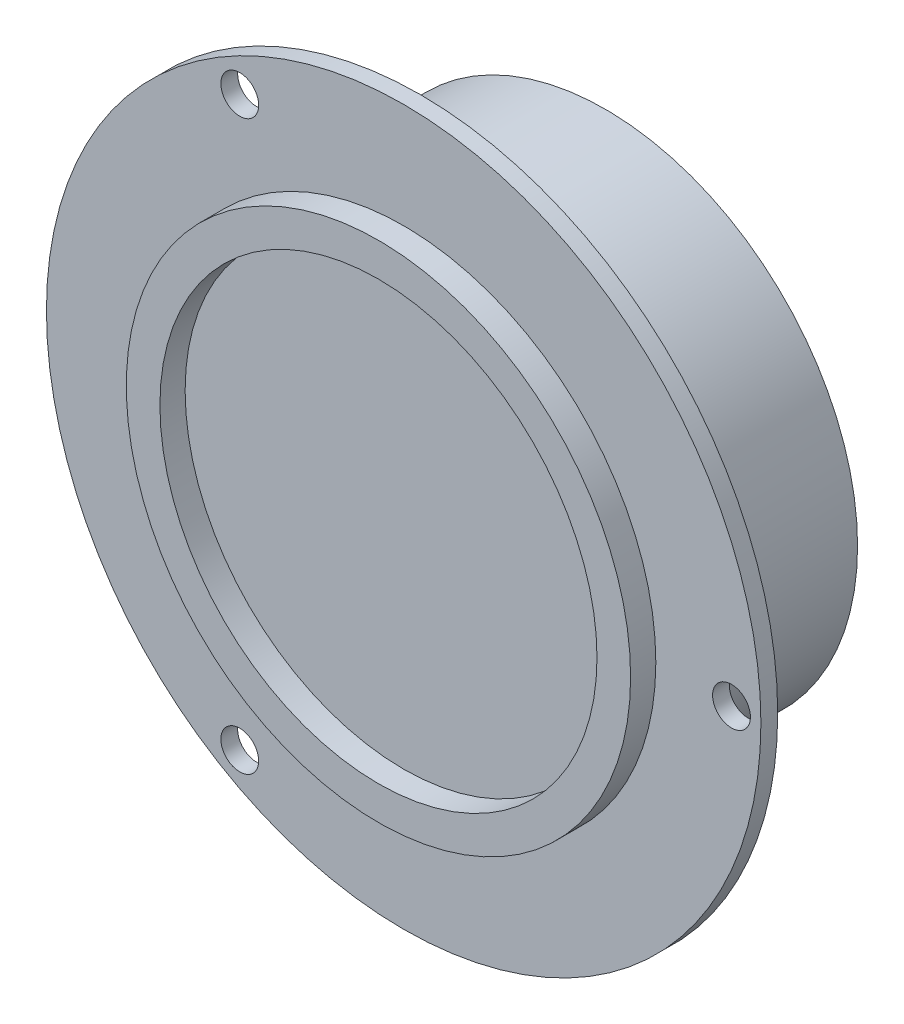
ISO-10303-21;
HEADER;
FILE_DESCRIPTION(('STEP AP214'),'2;1');
FILE_NAME('part.step','',(''),(''),'','','');
FILE_SCHEMA(('AUTOMOTIVE_DESIGN { 1 0 10303 214 1 1 1 1 }'));
ENDSEC;
DATA;
#1=APPLICATION_CONTEXT('core data for automotive mechanical design processes');
#2=APPLICATION_PROTOCOL_DEFINITION('international standard','automotive_design',2000,#1);
#3=PRODUCT_CONTEXT('',#1,'mechanical');
#4=PRODUCT('Part','Part','',(#3));
#5=PRODUCT_RELATED_PRODUCT_CATEGORY('part','',(#4));
#6=PRODUCT_DEFINITION_FORMATION('','',#4);
#7=PRODUCT_DEFINITION_CONTEXT('part definition',#1,'design');
#8=PRODUCT_DEFINITION('design','',#6,#7);
#9=PRODUCT_DEFINITION_SHAPE('','',#8);
#10=(LENGTH_UNIT() NAMED_UNIT(*) SI_UNIT(.MILLI.,.METRE.));
#11=(NAMED_UNIT(*) PLANE_ANGLE_UNIT() SI_UNIT($,.RADIAN.));
#12=(NAMED_UNIT(*) SI_UNIT($,.STERADIAN.) SOLID_ANGLE_UNIT());
#13=UNCERTAINTY_MEASURE_WITH_UNIT(LENGTH_MEASURE(1.E-05),#10,'distance_accuracy_value','');
#14=(GEOMETRIC_REPRESENTATION_CONTEXT(3) GLOBAL_UNCERTAINTY_ASSIGNED_CONTEXT((#13)) GLOBAL_UNIT_ASSIGNED_CONTEXT((#10,
#11,#12)) REPRESENTATION_CONTEXT('',''));
#15=CARTESIAN_POINT('',(0.,0.,0.));
#16=DIRECTION('',(0.,0.,1.));
#17=DIRECTION('',(1.,0.,0.));
#18=AXIS2_PLACEMENT_3D('',#15,#16,#17);
#19=CARTESIAN_POINT('',(0.,0.,0.));
#20=DIRECTION('',(0.,0.,1.));
#21=DIRECTION('',(1.,0.,0.));
#22=AXIS2_PLACEMENT_3D('',#19,#20,#21);
#23=PLANE('',#22);
#24=CARTESIAN_POINT('',(0.,0.,0.));
#25=DIRECTION('',(0.,0.,1.));
#26=DIRECTION('',(1.,0.,0.));
#27=AXIS2_PLACEMENT_3D('',#24,#25,#26);
#28=CIRCLE('',#27,30.);
#29=CARTESIAN_POINT('',(30.,0.,0.));
#30=VERTEX_POINT('',#29);
#31=EDGE_CURVE('E145',#30,#30,#28,.T.);
#32=ORIENTED_EDGE('',*,*,#31,.F.);
#33=EDGE_LOOP('',(#32));
#34=FACE_BOUND('',#33,.T.);
#35=DIRECTION('',(0.909272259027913,0.416201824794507,0.));
#36=VECTOR('',#35,1.);
#37=CARTESIAN_POINT('',(-5.64702244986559,4.01386814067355,0.));
#38=LINE('',#37,#36);
#39=CARTESIAN_POINT('',(-5.64702244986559,4.01386814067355,0.));
#40=VERTEX_POINT('',#39);
#41=CARTESIAN_POINT('',(0.652600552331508,6.89739896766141,0.));
#42=VERTEX_POINT('',#41);
#43=EDGE_CURVE('E108',#40,#42,#38,.T.);
#44=ORIENTED_EDGE('',*,*,#43,.F.);
#45=DIRECTION('',(0.0941947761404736,0.99555378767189,0.));
#46=VECTOR('',#45,1.);
#47=CARTESIAN_POINT('',(-6.2996230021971,-2.88353082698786,0.));
#48=LINE('',#47,#46);
#49=CARTESIAN_POINT('',(-6.2996230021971,-2.88353082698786,0.));
#50=VERTEX_POINT('',#49);
#51=EDGE_CURVE('E105',#50,#40,#48,.T.);
#52=ORIENTED_EDGE('',*,*,#51,.F.);
#53=DIRECTION('',(-0.815077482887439,0.579351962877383,0.));
#54=VECTOR('',#53,1.);
#55=CARTESIAN_POINT('',(-0.652600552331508,-6.89739896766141,0.));
#56=LINE('',#55,#54);
#57=CARTESIAN_POINT('',(-0.652600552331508,-6.89739896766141,0.));
#58=VERTEX_POINT('',#57);
#59=EDGE_CURVE('E163',#58,#50,#56,.T.);
#60=ORIENTED_EDGE('',*,*,#59,.F.);
#61=DIRECTION('',(-0.909272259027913,-0.416201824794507,0.));
#62=VECTOR('',#61,1.);
#63=CARTESIAN_POINT('',(5.64702244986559,-4.01386814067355,0.));
#64=LINE('',#63,#62);
#65=CARTESIAN_POINT('',(5.64702244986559,-4.01386814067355,0.));
#66=VERTEX_POINT('',#65);
#67=EDGE_CURVE('E180',#66,#58,#64,.T.);
#68=ORIENTED_EDGE('',*,*,#67,.F.);
#69=DIRECTION('',(-0.0941947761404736,-0.99555378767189,0.));
#70=VECTOR('',#69,1.);
#71=CARTESIAN_POINT('',(6.2996230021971,2.88353082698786,0.));
#72=LINE('',#71,#70);
#73=CARTESIAN_POINT('',(6.2996230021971,2.88353082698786,0.));
#74=VERTEX_POINT('',#73);
#75=EDGE_CURVE('E55',#74,#66,#72,.T.);
#76=ORIENTED_EDGE('',*,*,#75,.F.);
#77=DIRECTION('',(0.815077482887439,-0.579351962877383,0.));
#78=VECTOR('',#77,1.);
#79=CARTESIAN_POINT('',(0.652600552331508,6.89739896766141,0.));
#80=LINE('',#79,#78);
#81=EDGE_CURVE('E50',#42,#74,#80,.T.);
#82=ORIENTED_EDGE('',*,*,#81,.F.);
#83=EDGE_LOOP('',(#44,#52,#60,#68,#76,#82));
#84=FACE_BOUND('',#83,.T.);
#85=ADVANCED_FACE('F35',(#34,#84),#23,.F.);
#86=CARTESIAN_POINT('',(0.,0.,22.));
#87=DIRECTION('',(0.,0.,-1.));
#88=DIRECTION('',(-1.,0.,0.));
#89=AXIS2_PLACEMENT_3D('',#86,#87,#88);
#90=CYLINDRICAL_SURFACE('',#89,30.);
#91=CARTESIAN_POINT('',(0.,0.,22.));
#92=DIRECTION('',(0.,0.,1.));
#93=DIRECTION('',(1.,0.,0.));
#94=AXIS2_PLACEMENT_3D('',#91,#92,#93);
#95=CIRCLE('',#94,30.);
#96=CARTESIAN_POINT('',(30.,0.,22.));
#97=VERTEX_POINT('',#96);
#98=EDGE_CURVE('E43',#97,#97,#95,.T.);
#99=ORIENTED_EDGE('',*,*,#98,.F.);
#100=EDGE_LOOP('',(#99));
#101=FACE_BOUND('',#100,.T.);
#102=ORIENTED_EDGE('',*,*,#31,.T.);
#103=EDGE_LOOP('',(#102));
#104=FACE_BOUND('',#103,.T.);
#105=ADVANCED_FACE('F37',(#101,#104),#90,.T.);
#106=CARTESIAN_POINT('',(0.,0.,24.));
#107=DIRECTION('',(0.,0.,1.));
#108=DIRECTION('',(1.,0.,0.));
#109=AXIS2_PLACEMENT_3D('',#106,#107,#108);
#110=PLANE('',#109);
#111=CARTESIAN_POINT('',(0.,0.,24.));
#112=DIRECTION('',(0.,0.,1.));
#113=DIRECTION('',(1.,0.,0.));
#114=AXIS2_PLACEMENT_3D('',#111,#112,#113);
#115=CIRCLE('',#114,30.);
#116=CARTESIAN_POINT('',(30.,0.,24.));
#117=VERTEX_POINT('',#116);
#118=EDGE_CURVE('E112',#117,#117,#115,.T.);
#119=ORIENTED_EDGE('',*,*,#118,.F.);
#120=EDGE_LOOP('',(#119));
#121=FACE_BOUND('',#120,.T.);
#122=CARTESIAN_POINT('',(-19.5000000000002,-33.774990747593,24.));
#123=DIRECTION('',(0.,0.,1.));
#124=DIRECTION('',(1.,0.,0.));
#125=AXIS2_PLACEMENT_3D('',#122,#123,#124);
#126=CIRCLE('',#125,2.25);
#127=CARTESIAN_POINT('',(-17.2500000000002,-33.774990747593,24.));
#128=VERTEX_POINT('',#127);
#129=EDGE_CURVE('E130',#128,#128,#126,.T.);
#130=ORIENTED_EDGE('',*,*,#129,.F.);
#131=EDGE_LOOP('',(#130));
#132=FACE_BOUND('',#131,.T.);
#133=CARTESIAN_POINT('',(0.,0.,24.));
#134=DIRECTION('',(0.,0.,1.));
#135=DIRECTION('',(1.,0.,0.));
#136=AXIS2_PLACEMENT_3D('',#133,#134,#135);
#137=CIRCLE('',#136,42.5);
#138=CARTESIAN_POINT('',(42.5,0.,24.));
#139=VERTEX_POINT('',#138);
#140=EDGE_CURVE('E142',#139,#139,#137,.T.);
#141=ORIENTED_EDGE('',*,*,#140,.T.);
#142=EDGE_LOOP('',(#141));
#143=FACE_BOUND('',#142,.T.);
#144=CARTESIAN_POINT('',(39.,0.,24.));
#145=DIRECTION('',(0.,0.,1.));
#146=DIRECTION('',(1.,0.,0.));
#147=AXIS2_PLACEMENT_3D('',#144,#145,#146);
#148=CIRCLE('',#147,2.25);
#149=CARTESIAN_POINT('',(41.25,0.,24.));
#150=VERTEX_POINT('',#149);
#151=EDGE_CURVE('E136',#150,#150,#148,.T.);
#152=ORIENTED_EDGE('',*,*,#151,.F.);
#153=EDGE_LOOP('',(#152));
#154=FACE_BOUND('',#153,.T.);
#155=CARTESIAN_POINT('',(-19.4999999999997,33.7749907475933,24.));
#156=DIRECTION('',(0.,0.,1.));
#157=DIRECTION('',(1.,0.,0.));
#158=AXIS2_PLACEMENT_3D('',#155,#156,#157);
#159=CIRCLE('',#158,2.25000000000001);
#160=CARTESIAN_POINT('',(-17.2499999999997,33.7749907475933,24.));
#161=VERTEX_POINT('',#160);
#162=EDGE_CURVE('E124',#161,#161,#159,.T.);
#163=ORIENTED_EDGE('',*,*,#162,.F.);
#164=EDGE_LOOP('',(#163));
#165=FACE_BOUND('',#164,.T.);
#166=ADVANCED_FACE('F235',(#121,#132,#143,#154,#165),#110,.T.);
#167=CARTESIAN_POINT('',(0.,0.,22.));
#168=DIRECTION('',(0.,0.,1.));
#169=DIRECTION('',(1.,0.,0.));
#170=AXIS2_PLACEMENT_3D('',#167,#168,#169);
#171=PLANE('',#170);
#172=ORIENTED_EDGE('',*,*,#98,.T.);
#173=EDGE_LOOP('',(#172));
#174=FACE_BOUND('',#173,.T.);
#175=CARTESIAN_POINT('',(0.,0.,22.));
#176=DIRECTION('',(0.,0.,1.));
#177=DIRECTION('',(1.,0.,0.));
#178=AXIS2_PLACEMENT_3D('',#175,#176,#177);
#179=CIRCLE('',#178,42.5);
#180=CARTESIAN_POINT('',(42.5,0.,22.));
#181=VERTEX_POINT('',#180);
#182=EDGE_CURVE('E139',#181,#181,#179,.T.);
#183=ORIENTED_EDGE('',*,*,#182,.F.);
#184=EDGE_LOOP('',(#183));
#185=FACE_BOUND('',#184,.T.);
#186=CARTESIAN_POINT('',(39.,0.,22.));
#187=DIRECTION('',(0.,0.,1.));
#188=DIRECTION('',(1.,0.,0.));
#189=AXIS2_PLACEMENT_3D('',#186,#187,#188);
#190=CIRCLE('',#189,2.25);
#191=CARTESIAN_POINT('',(41.25,0.,22.));
#192=VERTEX_POINT('',#191);
#193=EDGE_CURVE('E133',#192,#192,#190,.T.);
#194=ORIENTED_EDGE('',*,*,#193,.T.);
#195=EDGE_LOOP('',(#194));
#196=FACE_BOUND('',#195,.T.);
#197=CARTESIAN_POINT('',(-19.5000000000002,-33.774990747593,22.));
#198=DIRECTION('',(0.,0.,1.));
#199=DIRECTION('',(1.,0.,0.));
#200=AXIS2_PLACEMENT_3D('',#197,#198,#199);
#201=CIRCLE('',#200,2.25);
#202=CARTESIAN_POINT('',(-17.2500000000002,-33.774990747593,22.));
#203=VERTEX_POINT('',#202);
#204=EDGE_CURVE('E127',#203,#203,#201,.T.);
#205=ORIENTED_EDGE('',*,*,#204,.T.);
#206=EDGE_LOOP('',(#205));
#207=FACE_BOUND('',#206,.T.);
#208=CARTESIAN_POINT('',(-19.4999999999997,33.7749907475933,22.));
#209=DIRECTION('',(0.,0.,1.));
#210=DIRECTION('',(1.,0.,0.));
#211=AXIS2_PLACEMENT_3D('',#208,#209,#210);
#212=CIRCLE('',#211,2.25000000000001);
#213=CARTESIAN_POINT('',(-17.2499999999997,33.7749907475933,22.));
#214=VERTEX_POINT('',#213);
#215=EDGE_CURVE('E121',#214,#214,#212,.T.);
#216=ORIENTED_EDGE('',*,*,#215,.T.);
#217=EDGE_LOOP('',(#216));
#218=FACE_BOUND('',#217,.T.);
#219=ADVANCED_FACE('F238',(#174,#185,#196,#207,#218),#171,.F.);
#220=CARTESIAN_POINT('',(0.,0.,24.));
#221=DIRECTION('',(0.,0.,-1.));
#222=DIRECTION('',(-1.,0.,0.));
#223=AXIS2_PLACEMENT_3D('',#220,#221,#222);
#224=CYLINDRICAL_SURFACE('',#223,42.5);
#225=ORIENTED_EDGE('',*,*,#140,.F.);
#226=EDGE_LOOP('',(#225));
#227=FACE_BOUND('',#226,.T.);
#228=ORIENTED_EDGE('',*,*,#182,.T.);
#229=EDGE_LOOP('',(#228));
#230=FACE_BOUND('',#229,.T.);
#231=ADVANCED_FACE('F233',(#227,#230),#224,.T.);
#232=CARTESIAN_POINT('',(39.,0.,24.));
#233=DIRECTION('',(0.,0.,-1.));
#234=DIRECTION('',(-1.,0.,0.));
#235=AXIS2_PLACEMENT_3D('',#232,#233,#234);
#236=CYLINDRICAL_SURFACE('',#235,2.25);
#237=ORIENTED_EDGE('',*,*,#151,.T.);
#238=EDGE_LOOP('',(#237));
#239=FACE_BOUND('',#238,.T.);
#240=ORIENTED_EDGE('',*,*,#193,.F.);
#241=EDGE_LOOP('',(#240));
#242=FACE_BOUND('',#241,.T.);
#243=ADVANCED_FACE('F229',(#239,#242),#236,.F.);
#244=CARTESIAN_POINT('',(-19.5000000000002,-33.774990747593,24.));
#245=DIRECTION('',(0.,0.,-1.));
#246=DIRECTION('',(-1.,0.,0.));
#247=AXIS2_PLACEMENT_3D('',#244,#245,#246);
#248=CYLINDRICAL_SURFACE('',#247,2.25);
#249=ORIENTED_EDGE('',*,*,#129,.T.);
#250=EDGE_LOOP('',(#249));
#251=FACE_BOUND('',#250,.T.);
#252=ORIENTED_EDGE('',*,*,#204,.F.);
#253=EDGE_LOOP('',(#252));
#254=FACE_BOUND('',#253,.T.);
#255=ADVANCED_FACE('F225',(#251,#254),#248,.F.);
#256=CARTESIAN_POINT('',(-19.4999999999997,33.7749907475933,24.));
#257=DIRECTION('',(0.,0.,-1.));
#258=DIRECTION('',(-1.,0.,0.));
#259=AXIS2_PLACEMENT_3D('',#256,#257,#258);
#260=CYLINDRICAL_SURFACE('',#259,2.25000000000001);
#261=ORIENTED_EDGE('',*,*,#162,.T.);
#262=EDGE_LOOP('',(#261));
#263=FACE_BOUND('',#262,.T.);
#264=ORIENTED_EDGE('',*,*,#215,.F.);
#265=EDGE_LOOP('',(#264));
#266=FACE_BOUND('',#265,.T.);
#267=ADVANCED_FACE('F218',(#263,#266),#260,.F.);
#268=CARTESIAN_POINT('',(0.,0.,27.));
#269=DIRECTION('',(0.,0.,1.));
#270=DIRECTION('',(1.,0.,0.));
#271=AXIS2_PLACEMENT_3D('',#268,#269,#270);
#272=PLANE('',#271);
#273=CARTESIAN_POINT('',(0.,0.,27.));
#274=DIRECTION('',(0.,0.,1.));
#275=DIRECTION('',(1.,0.,0.));
#276=AXIS2_PLACEMENT_3D('',#273,#274,#275);
#277=CIRCLE('',#276,30.);
#278=CARTESIAN_POINT('',(30.,0.,27.));
#279=VERTEX_POINT('',#278);
#280=EDGE_CURVE('E118',#279,#279,#277,.T.);
#281=ORIENTED_EDGE('',*,*,#280,.T.);
#282=EDGE_LOOP('',(#281));
#283=FACE_BOUND('',#282,.T.);
#284=CARTESIAN_POINT('',(0.,0.,27.));
#285=DIRECTION('',(0.,0.,1.));
#286=DIRECTION('',(1.,0.,0.));
#287=AXIS2_PLACEMENT_3D('',#284,#285,#286);
#288=CIRCLE('',#287,26.);
#289=CARTESIAN_POINT('',(26.,0.,27.));
#290=VERTEX_POINT('',#289);
#291=EDGE_CURVE('E109',#290,#290,#288,.T.);
#292=ORIENTED_EDGE('',*,*,#291,.F.);
#293=EDGE_LOOP('',(#292));
#294=FACE_BOUND('',#293,.T.);
#295=ADVANCED_FACE('F215',(#283,#294),#272,.T.);
#296=CARTESIAN_POINT('',(0.,0.,27.));
#297=DIRECTION('',(0.,0.,-1.));
#298=DIRECTION('',(-1.,0.,0.));
#299=AXIS2_PLACEMENT_3D('',#296,#297,#298);
#300=CYLINDRICAL_SURFACE('',#299,30.);
#301=ORIENTED_EDGE('',*,*,#280,.F.);
#302=EDGE_LOOP('',(#301));
#303=FACE_BOUND('',#302,.T.);
#304=ORIENTED_EDGE('',*,*,#118,.T.);
#305=EDGE_LOOP('',(#304));
#306=FACE_BOUND('',#305,.T.);
#307=ADVANCED_FACE('F213',(#303,#306),#300,.T.);
#308=CARTESIAN_POINT('',(0.,0.,27.));
#309=DIRECTION('',(0.,0.,-1.));
#310=DIRECTION('',(-1.,0.,0.));
#311=AXIS2_PLACEMENT_3D('',#308,#309,#310);
#312=CYLINDRICAL_SURFACE('',#311,26.);
#313=ORIENTED_EDGE('',*,*,#291,.T.);
#314=EDGE_LOOP('',(#313));
#315=FACE_BOUND('',#314,.T.);
#316=CARTESIAN_POINT('',(0.,0.,24.));
#317=DIRECTION('',(0.,0.,1.));
#318=DIRECTION('',(1.,0.,0.));
#319=AXIS2_PLACEMENT_3D('',#316,#317,#318);
#320=CIRCLE('',#319,26.);
#321=CARTESIAN_POINT('',(26.,0.,24.));
#322=VERTEX_POINT('',#321);
#323=EDGE_CURVE('E11',#322,#322,#320,.F.);
#324=ORIENTED_EDGE('',*,*,#323,.T.);
#325=EDGE_LOOP('',(#324));
#326=FACE_BOUND('',#325,.T.);
#327=ADVANCED_FACE('F210',(#315,#326),#312,.F.);
#328=ORIENTED_EDGE('',*,*,#323,.F.);
#329=EDGE_LOOP('',(#328));
#330=FACE_BOUND('',#329,.T.);
#331=ADVANCED_FACE('F209',(#330),#110,.T.);
#332=CARTESIAN_POINT('',(-5.64702244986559,4.01386814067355,-10.));
#333=DIRECTION('',(0.416201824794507,-0.909272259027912,0.));
#334=DIRECTION('',(0.909272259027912,0.416201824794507,0.));
#335=AXIS2_PLACEMENT_3D('',#332,#333,#334);
#336=PLANE('',#335);
#337=ORIENTED_EDGE('',*,*,#43,.T.);
#338=DIRECTION('',(0.,0.,1.));
#339=VECTOR('',#338,1.);
#340=CARTESIAN_POINT('',(0.652600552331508,6.89739896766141,-10.));
#341=LINE('',#340,#339);
#342=CARTESIAN_POINT('',(0.652600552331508,6.89739896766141,-10.));
#343=VERTEX_POINT('',#342);
#344=EDGE_CURVE('E89',#343,#42,#341,.T.);
#345=ORIENTED_EDGE('',*,*,#344,.F.);
#346=DIRECTION('',(0.909272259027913,0.416201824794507,0.));
#347=VECTOR('',#346,1.);
#348=CARTESIAN_POINT('',(-5.64702244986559,4.01386814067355,-10.));
#349=LINE('',#348,#347);
#350=CARTESIAN_POINT('',(-5.64702244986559,4.01386814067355,-10.));
#351=VERTEX_POINT('',#350);
#352=EDGE_CURVE('E96',#351,#343,#349,.T.);
#353=ORIENTED_EDGE('',*,*,#352,.F.);
#354=DIRECTION('',(0.,0.,1.));
#355=VECTOR('',#354,1.);
#356=CARTESIAN_POINT('',(-5.64702244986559,4.01386814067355,-10.));
#357=LINE('',#356,#355);
#358=EDGE_CURVE('E160',#351,#40,#357,.T.);
#359=ORIENTED_EDGE('',*,*,#358,.T.);
#360=EDGE_LOOP('',(#337,#345,#353,#359));
#361=FACE_BOUND('',#360,.T.);
#362=ADVANCED_FACE('F107',(#361),#336,.F.);
#363=CARTESIAN_POINT('',(0.652600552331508,6.89739896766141,-10.));
#364=DIRECTION('',(-0.579351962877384,-0.815077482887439,0.));
#365=DIRECTION('',(0.815077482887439,-0.579351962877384,0.));
#366=AXIS2_PLACEMENT_3D('',#363,#364,#365);
#367=PLANE('',#366);
#368=ORIENTED_EDGE('',*,*,#81,.T.);
#369=DIRECTION('',(0.,0.,1.));
#370=VECTOR('',#369,1.);
#371=CARTESIAN_POINT('',(6.2996230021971,2.88353082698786,-10.));
#372=LINE('',#371,#370);
#373=CARTESIAN_POINT('',(6.2996230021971,2.88353082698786,-10.));
#374=VERTEX_POINT('',#373);
#375=EDGE_CURVE('E92',#374,#74,#372,.T.);
#376=ORIENTED_EDGE('',*,*,#375,.F.);
#377=DIRECTION('',(0.815077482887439,-0.579351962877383,0.));
#378=VECTOR('',#377,1.);
#379=CARTESIAN_POINT('',(0.652600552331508,6.89739896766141,-10.));
#380=LINE('',#379,#378);
#381=EDGE_CURVE('E85',#343,#374,#380,.T.);
#382=ORIENTED_EDGE('',*,*,#381,.F.);
#383=ORIENTED_EDGE('',*,*,#344,.T.);
#384=EDGE_LOOP('',(#368,#376,#382,#383));
#385=FACE_BOUND('',#384,.T.);
#386=ADVANCED_FACE('F87',(#385),#367,.F.);
#387=CARTESIAN_POINT('',(6.2996230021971,2.88353082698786,-10.));
#388=DIRECTION('',(-0.99555378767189,0.0941947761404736,0.));
#389=DIRECTION('',(-0.0941947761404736,-0.99555378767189,0.));
#390=AXIS2_PLACEMENT_3D('',#387,#388,#389);
#391=PLANE('',#390);
#392=ORIENTED_EDGE('',*,*,#75,.T.);
#393=DIRECTION('',(0.,0.,1.));
#394=VECTOR('',#393,1.);
#395=CARTESIAN_POINT('',(5.64702244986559,-4.01386814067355,-10.));
#396=LINE('',#395,#394);
#397=CARTESIAN_POINT('',(5.64702244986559,-4.01386814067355,-10.));
#398=VERTEX_POINT('',#397);
#399=EDGE_CURVE('E114',#398,#66,#396,.T.);
#400=ORIENTED_EDGE('',*,*,#399,.F.);
#401=DIRECTION('',(-0.0941947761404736,-0.99555378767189,0.));
#402=VECTOR('',#401,1.);
#403=CARTESIAN_POINT('',(6.2996230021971,2.88353082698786,-10.));
#404=LINE('',#403,#402);
#405=EDGE_CURVE('E95',#374,#398,#404,.T.);
#406=ORIENTED_EDGE('',*,*,#405,.F.);
#407=ORIENTED_EDGE('',*,*,#375,.T.);
#408=EDGE_LOOP('',(#392,#400,#406,#407));
#409=FACE_BOUND('',#408,.T.);
#410=ADVANCED_FACE('F183',(#409),#391,.F.);
#411=CARTESIAN_POINT('',(5.64702244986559,-4.01386814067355,-10.));
#412=DIRECTION('',(-0.416201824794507,0.909272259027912,0.));
#413=DIRECTION('',(-0.909272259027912,-0.416201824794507,0.));
#414=AXIS2_PLACEMENT_3D('',#411,#412,#413);
#415=PLANE('',#414);
#416=ORIENTED_EDGE('',*,*,#67,.T.);
#417=DIRECTION('',(0.,0.,1.));
#418=VECTOR('',#417,1.);
#419=CARTESIAN_POINT('',(-0.652600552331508,-6.89739896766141,-10.));
#420=LINE('',#419,#418);
#421=CARTESIAN_POINT('',(-0.652600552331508,-6.89739896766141,-10.));
#422=VERTEX_POINT('',#421);
#423=EDGE_CURVE('E166',#422,#58,#420,.T.);
#424=ORIENTED_EDGE('',*,*,#423,.F.);
#425=DIRECTION('',(-0.909272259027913,-0.416201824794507,0.));
#426=VECTOR('',#425,1.);
#427=CARTESIAN_POINT('',(5.64702244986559,-4.01386814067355,-10.));
#428=LINE('',#427,#426);
#429=EDGE_CURVE('E181',#398,#422,#428,.T.);
#430=ORIENTED_EDGE('',*,*,#429,.F.);
#431=ORIENTED_EDGE('',*,*,#399,.T.);
#432=EDGE_LOOP('',(#416,#424,#430,#431));
#433=FACE_BOUND('',#432,.T.);
#434=ADVANCED_FACE('F178',(#433),#415,.F.);
#435=CARTESIAN_POINT('',(-0.652600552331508,-6.89739896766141,-10.));
#436=DIRECTION('',(0.579351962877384,0.815077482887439,0.));
#437=DIRECTION('',(-0.815077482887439,0.579351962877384,0.));
#438=AXIS2_PLACEMENT_3D('',#435,#436,#437);
#439=PLANE('',#438);
#440=ORIENTED_EDGE('',*,*,#59,.T.);
#441=DIRECTION('',(0.,0.,1.));
#442=VECTOR('',#441,1.);
#443=CARTESIAN_POINT('',(-6.2996230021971,-2.88353082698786,-10.));
#444=LINE('',#443,#442);
#445=CARTESIAN_POINT('',(-6.2996230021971,-2.88353082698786,-10.));
#446=VERTEX_POINT('',#445);
#447=EDGE_CURVE('E162',#446,#50,#444,.T.);
#448=ORIENTED_EDGE('',*,*,#447,.F.);
#449=DIRECTION('',(-0.815077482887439,0.579351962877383,0.));
#450=VECTOR('',#449,1.);
#451=CARTESIAN_POINT('',(-0.652600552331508,-6.89739896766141,-10.));
#452=LINE('',#451,#450);
#453=EDGE_CURVE('E168',#422,#446,#452,.T.);
#454=ORIENTED_EDGE('',*,*,#453,.F.);
#455=ORIENTED_EDGE('',*,*,#423,.T.);
#456=EDGE_LOOP('',(#440,#448,#454,#455));
#457=FACE_BOUND('',#456,.T.);
#458=ADVANCED_FACE('F188',(#457),#439,.F.);
#459=CARTESIAN_POINT('',(-6.2996230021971,-2.88353082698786,-10.));
#460=DIRECTION('',(0.99555378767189,-0.0941947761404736,0.));
#461=DIRECTION('',(0.0941947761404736,0.99555378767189,0.));
#462=AXIS2_PLACEMENT_3D('',#459,#460,#461);
#463=PLANE('',#462);
#464=ORIENTED_EDGE('',*,*,#51,.T.);
#465=ORIENTED_EDGE('',*,*,#358,.F.);
#466=DIRECTION('',(0.0941947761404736,0.99555378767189,0.));
#467=VECTOR('',#466,1.);
#468=CARTESIAN_POINT('',(-6.2996230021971,-2.88353082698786,-10.));
#469=LINE('',#468,#467);
#470=EDGE_CURVE('E101',#446,#351,#469,.T.);
#471=ORIENTED_EDGE('',*,*,#470,.F.);
#472=ORIENTED_EDGE('',*,*,#447,.T.);
#473=EDGE_LOOP('',(#464,#465,#471,#472));
#474=FACE_BOUND('',#473,.T.);
#475=ADVANCED_FACE('F159',(#474),#463,.F.);
#476=CARTESIAN_POINT('',(0.,0.,-10.));
#477=DIRECTION('',(0.,0.,-1.));
#478=DIRECTION('',(-1.,0.,0.));
#479=AXIS2_PLACEMENT_3D('',#476,#477,#478);
#480=PLANE('',#479);
#481=ORIENTED_EDGE('',*,*,#352,.T.);
#482=ORIENTED_EDGE('',*,*,#381,.T.);
#483=ORIENTED_EDGE('',*,*,#405,.T.);
#484=ORIENTED_EDGE('',*,*,#429,.T.);
#485=ORIENTED_EDGE('',*,*,#453,.T.);
#486=ORIENTED_EDGE('',*,*,#470,.T.);
#487=EDGE_LOOP('',(#481,#482,#483,#484,#485,#486));
#488=FACE_BOUND('',#487,.T.);
#489=ADVANCED_FACE('F99',(#488),#480,.T.);
#490=CLOSED_SHELL('',(#85,#105,#166,#219,#231,#243,#255,#267,#295,#307,#327,#331,#362,#386,#410,
#434,#458,#475,#489));
#491=MANIFOLD_SOLID_BREP('B2',#490);
#492=ADVANCED_BREP_SHAPE_REPRESENTATION('',(#18,#491),#14);
#493=SHAPE_DEFINITION_REPRESENTATION(#9,#492);
ENDSEC;
END-ISO-10303-21;
